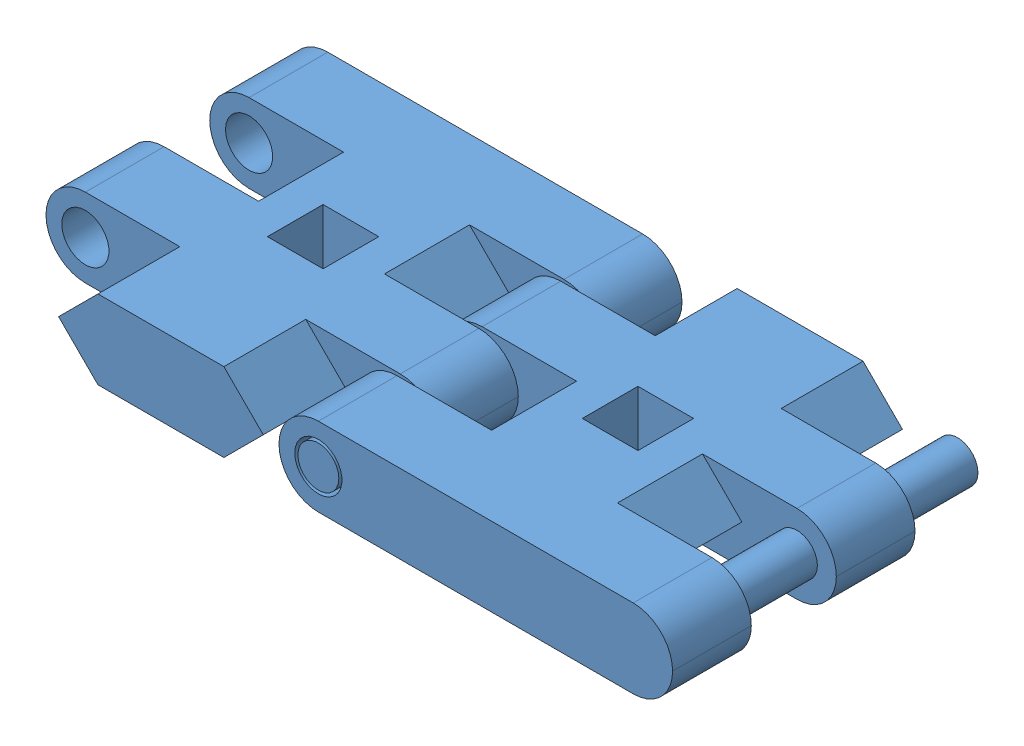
SolidWorks assembly Hingle.SLDASM, configuration Default (file format 5000). Lengths in mm.
Overall size (45 5 20.6).
2 component instances, 1 part files, 3 mates.
Components (placement in the parent):
- Link-1: Link.SLDPRT [Default] at origin size (25 5 20.6)
- Link-2: Link.SLDPRT [Default] at (20 0 0) x (1 0 0) z (0 0 -1) size (25 5 20.6)
Mates (geometry in assembly coordinates):
- Concentric1: concentric anti-aligned: cylinder of Link-1 through (10 0 10.3) axis (0 0 -1) radius 1.3; cylinder of Link-2 through (10 0 -10.3) axis (0 0 1) radius 1.5
- Coincident1: coincident aligned: plane of Link-1 through (0 2.5 -10.3) normal (0 0 -1); plane of Link-2 through (13.5 -2.5 -10.3) normal (0 0 -1)
- Init: unknown aligned: plane of Link-1 through (0 2.5 0) normal (0 1 0); plane of Link-2 through (20 2.5 0) normal (0 1 0)
